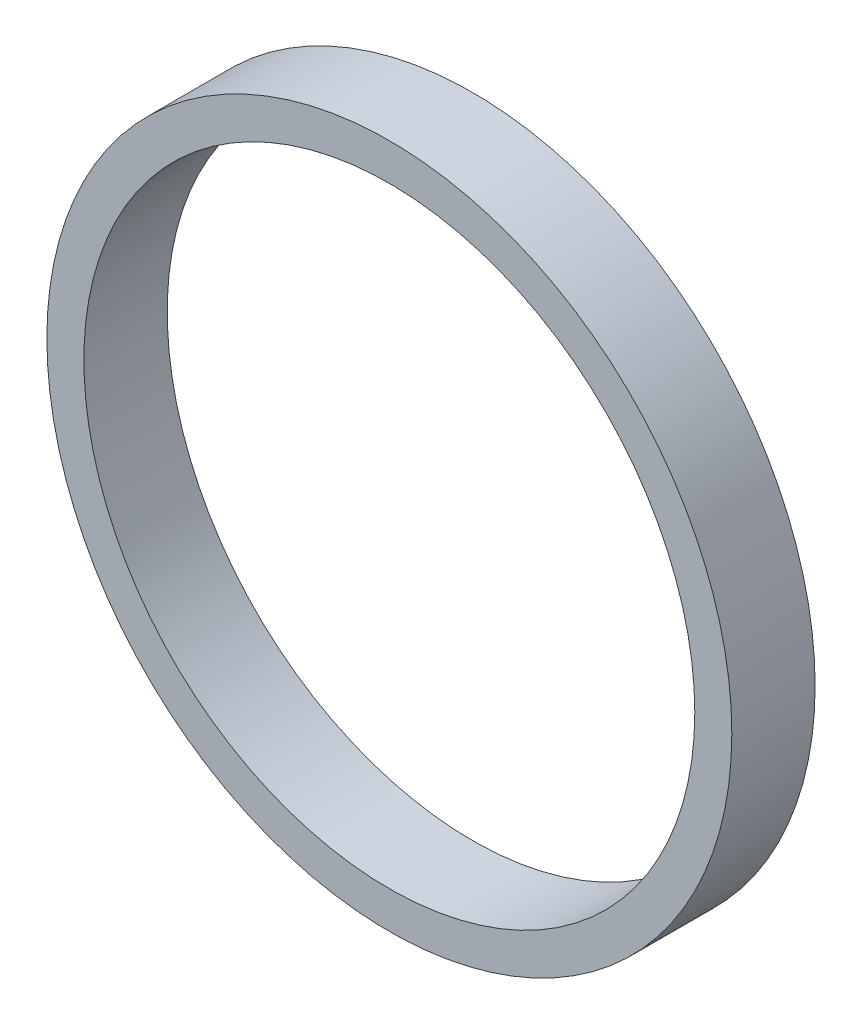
ISO-10303-21;
HEADER;
FILE_DESCRIPTION(('STEP AP214'),'2;1');
FILE_NAME('part.step','',(''),(''),'','','');
FILE_SCHEMA(('AUTOMOTIVE_DESIGN { 1 0 10303 214 1 1 1 1 }'));
ENDSEC;
DATA;
#1=APPLICATION_CONTEXT('core data for automotive mechanical design processes');
#2=APPLICATION_PROTOCOL_DEFINITION('international standard','automotive_design',2000,#1);
#3=PRODUCT_CONTEXT('',#1,'mechanical');
#4=PRODUCT('Part','Part','',(#3));
#5=PRODUCT_RELATED_PRODUCT_CATEGORY('part','',(#4));
#6=PRODUCT_DEFINITION_FORMATION('','',#4);
#7=PRODUCT_DEFINITION_CONTEXT('part definition',#1,'design');
#8=PRODUCT_DEFINITION('design','',#6,#7);
#9=PRODUCT_DEFINITION_SHAPE('','',#8);
#10=(LENGTH_UNIT() NAMED_UNIT(*) SI_UNIT(.MILLI.,.METRE.));
#11=(NAMED_UNIT(*) PLANE_ANGLE_UNIT() SI_UNIT($,.RADIAN.));
#12=(NAMED_UNIT(*) SI_UNIT($,.STERADIAN.) SOLID_ANGLE_UNIT());
#13=UNCERTAINTY_MEASURE_WITH_UNIT(LENGTH_MEASURE(1.E-05),#10,'distance_accuracy_value','');
#14=(GEOMETRIC_REPRESENTATION_CONTEXT(3) GLOBAL_UNCERTAINTY_ASSIGNED_CONTEXT((#13)) GLOBAL_UNIT_ASSIGNED_CONTEXT((#10,
#11,#12)) REPRESENTATION_CONTEXT('',''));
#15=CARTESIAN_POINT('',(0.,0.,0.));
#16=DIRECTION('',(0.,0.,1.));
#17=DIRECTION('',(1.,0.,0.));
#18=AXIS2_PLACEMENT_3D('',#15,#16,#17);
#19=CARTESIAN_POINT('',(0.,0.,5.715));
#20=DIRECTION('',(0.,0.,1.));
#21=DIRECTION('',(1.,0.,0.));
#22=AXIS2_PLACEMENT_3D('',#19,#20,#21);
#23=PLANE('',#22);
#24=CARTESIAN_POINT('',(0.,0.,5.715));
#25=DIRECTION('',(0.,0.,1.));
#26=DIRECTION('',(1.,0.,0.));
#27=AXIS2_PLACEMENT_3D('',#24,#25,#26);
#28=CIRCLE('',#27,46.99);
#29=CARTESIAN_POINT('',(46.99,0.,5.715));
#30=VERTEX_POINT('',#29);
#31=EDGE_CURVE('E10',#30,#30,#28,.T.);
#32=ORIENTED_EDGE('',*,*,#31,.T.);
#33=EDGE_LOOP('',(#32));
#34=FACE_BOUND('',#33,.T.);
#35=CARTESIAN_POINT('',(0.,0.,5.715));
#36=DIRECTION('',(0.,0.,1.));
#37=DIRECTION('',(1.,0.,0.));
#38=AXIS2_PLACEMENT_3D('',#35,#36,#37);
#39=CIRCLE('',#38,41.91);
#40=CARTESIAN_POINT('',(41.91,0.,5.715));
#41=VERTEX_POINT('',#40);
#42=EDGE_CURVE('E42',#41,#41,#39,.T.);
#43=ORIENTED_EDGE('',*,*,#42,.F.);
#44=EDGE_LOOP('',(#43));
#45=FACE_BOUND('',#44,.T.);
#46=ADVANCED_FACE('F31',(#34,#45),#23,.T.);
#47=CARTESIAN_POINT('',(0.,0.,-5.715));
#48=DIRECTION('',(0.,0.,1.));
#49=DIRECTION('',(1.,0.,0.));
#50=AXIS2_PLACEMENT_3D('',#47,#48,#49);
#51=PLANE('',#50);
#52=CARTESIAN_POINT('',(0.,0.,-5.715));
#53=DIRECTION('',(0.,0.,1.));
#54=DIRECTION('',(1.,0.,0.));
#55=AXIS2_PLACEMENT_3D('',#52,#53,#54);
#56=CIRCLE('',#55,46.99);
#57=CARTESIAN_POINT('',(46.99,0.,-5.715));
#58=VERTEX_POINT('',#57);
#59=EDGE_CURVE('E35',#58,#58,#56,.T.);
#60=ORIENTED_EDGE('',*,*,#59,.F.);
#61=EDGE_LOOP('',(#60));
#62=FACE_BOUND('',#61,.T.);
#63=CARTESIAN_POINT('',(0.,0.,-5.715));
#64=DIRECTION('',(0.,0.,1.));
#65=DIRECTION('',(1.,0.,0.));
#66=AXIS2_PLACEMENT_3D('',#63,#64,#65);
#67=CIRCLE('',#66,41.91);
#68=CARTESIAN_POINT('',(41.91,0.,-5.715));
#69=VERTEX_POINT('',#68);
#70=EDGE_CURVE('E44',#69,#69,#67,.T.);
#71=ORIENTED_EDGE('',*,*,#70,.T.);
#72=EDGE_LOOP('',(#71));
#73=FACE_BOUND('',#72,.T.);
#74=ADVANCED_FACE('F54',(#62,#73),#51,.F.);
#75=CARTESIAN_POINT('',(0.,0.,5.715));
#76=DIRECTION('',(0.,0.,-1.));
#77=DIRECTION('',(-1.,0.,0.));
#78=AXIS2_PLACEMENT_3D('',#75,#76,#77);
#79=CYLINDRICAL_SURFACE('',#78,46.99);
#80=ORIENTED_EDGE('',*,*,#31,.F.);
#81=EDGE_LOOP('',(#80));
#82=FACE_BOUND('',#81,.T.);
#83=ORIENTED_EDGE('',*,*,#59,.T.);
#84=EDGE_LOOP('',(#83));
#85=FACE_BOUND('',#84,.T.);
#86=ADVANCED_FACE('F33',(#82,#85),#79,.T.);
#87=CARTESIAN_POINT('',(0.,0.,5.715));
#88=DIRECTION('',(0.,0.,-1.));
#89=DIRECTION('',(-1.,0.,0.));
#90=AXIS2_PLACEMENT_3D('',#87,#88,#89);
#91=CYLINDRICAL_SURFACE('',#90,41.91);
#92=ORIENTED_EDGE('',*,*,#42,.T.);
#93=EDGE_LOOP('',(#92));
#94=FACE_BOUND('',#93,.T.);
#95=ORIENTED_EDGE('',*,*,#70,.F.);
#96=EDGE_LOOP('',(#95));
#97=FACE_BOUND('',#96,.T.);
#98=ADVANCED_FACE('F50',(#94,#97),#91,.F.);
#99=CLOSED_SHELL('',(#46,#74,#86,#98));
#100=MANIFOLD_SOLID_BREP('B2',#99);
#101=ADVANCED_BREP_SHAPE_REPRESENTATION('',(#18,#100),#14);
#102=SHAPE_DEFINITION_REPRESENTATION(#9,#101);
ENDSEC;
END-ISO-10303-21;
